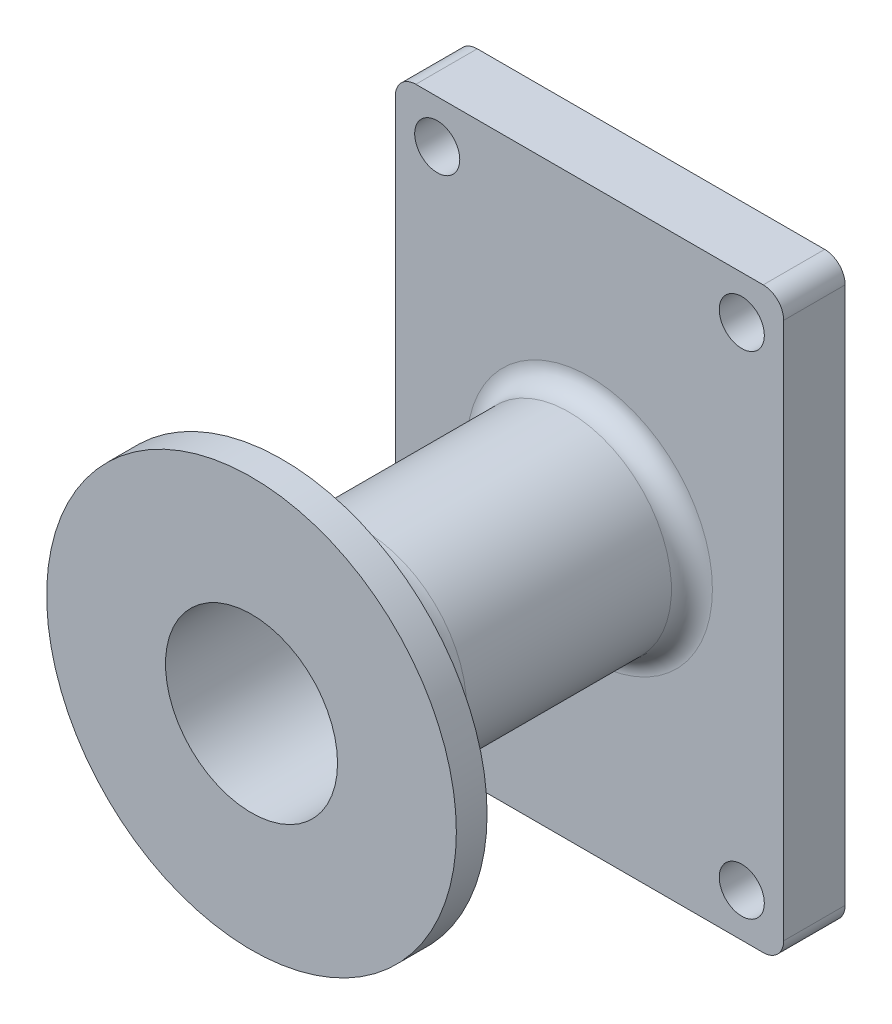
ISO-10303-21;
HEADER;
FILE_DESCRIPTION(('STEP AP214'),'2;1');
FILE_NAME('part.step','',(''),(''),'','','');
FILE_SCHEMA(('AUTOMOTIVE_DESIGN { 1 0 10303 214 1 1 1 1 }'));
ENDSEC;
DATA;
#1=APPLICATION_CONTEXT('core data for automotive mechanical design processes');
#2=APPLICATION_PROTOCOL_DEFINITION('international standard','automotive_design',2000,#1);
#3=PRODUCT_CONTEXT('',#1,'mechanical');
#4=PRODUCT('Part','Part','',(#3));
#5=PRODUCT_RELATED_PRODUCT_CATEGORY('part','',(#4));
#6=PRODUCT_DEFINITION_FORMATION('','',#4);
#7=PRODUCT_DEFINITION_CONTEXT('part definition',#1,'design');
#8=PRODUCT_DEFINITION('design','',#6,#7);
#9=PRODUCT_DEFINITION_SHAPE('','',#8);
#10=(LENGTH_UNIT() NAMED_UNIT(*) SI_UNIT(.MILLI.,.METRE.));
#11=(NAMED_UNIT(*) PLANE_ANGLE_UNIT() SI_UNIT($,.RADIAN.));
#12=(NAMED_UNIT(*) SI_UNIT($,.STERADIAN.) SOLID_ANGLE_UNIT());
#13=UNCERTAINTY_MEASURE_WITH_UNIT(LENGTH_MEASURE(1.E-05),#10,'distance_accuracy_value','');
#14=(GEOMETRIC_REPRESENTATION_CONTEXT(3) GLOBAL_UNCERTAINTY_ASSIGNED_CONTEXT((#13)) GLOBAL_UNIT_ASSIGNED_CONTEXT((#10,
#11,#12)) REPRESENTATION_CONTEXT('',''));
#15=CARTESIAN_POINT('',(0.,0.,0.));
#16=DIRECTION('',(0.,0.,1.));
#17=DIRECTION('',(1.,0.,0.));
#18=AXIS2_PLACEMENT_3D('',#15,#16,#17);
#19=CARTESIAN_POINT('',(-218.862203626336,-296.144190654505,3.));
#20=DIRECTION('',(0.,0.,-1.));
#21=DIRECTION('',(-1.,0.,0.));
#22=AXIS2_PLACEMENT_3D('',#19,#20,#21);
#23=PLANE('',#22);
#24=CARTESIAN_POINT('',(-227.342156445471,-283.028662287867,3.));
#25=DIRECTION('',(0.,0.,-1.));
#26=DIRECTION('',(-1.,0.,0.));
#27=AXIS2_PLACEMENT_3D('',#24,#25,#26);
#28=CIRCLE('',#27,5.99999999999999);
#29=CARTESIAN_POINT('',(-233.342156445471,-283.028662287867,3.));
#30=VERTEX_POINT('',#29);
#31=EDGE_CURVE('E11',#30,#30,#28,.T.);
#32=ORIENTED_EDGE('',*,*,#31,.T.);
#33=EDGE_LOOP('',(#32));
#34=FACE_BOUND('',#33,.T.);
#35=CARTESIAN_POINT('',(-234.775876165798,-295.028662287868,3.));
#36=DIRECTION('',(0.,0.,1.));
#37=DIRECTION('',(1.,0.,0.));
#38=AXIS2_PLACEMENT_3D('',#35,#36,#37);
#39=CIRCLE('',#38,1.09999999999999);
#40=CARTESIAN_POINT('',(-233.675876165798,-295.028662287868,3.));
#41=VERTEX_POINT('',#40);
#42=EDGE_CURVE('E248',#41,#41,#39,.T.);
#43=ORIENTED_EDGE('',*,*,#42,.F.);
#44=EDGE_LOOP('',(#43));
#45=FACE_BOUND('',#44,.T.);
#46=CARTESIAN_POINT('',(-219.908436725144,-271.028662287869,3.));
#47=DIRECTION('',(0.,0.,1.));
#48=DIRECTION('',(1.,0.,0.));
#49=AXIS2_PLACEMENT_3D('',#46,#47,#48);
#50=CIRCLE('',#49,1.09999999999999);
#51=CARTESIAN_POINT('',(-218.808436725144,-271.028662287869,3.));
#52=VERTEX_POINT('',#51);
#53=EDGE_CURVE('E135',#52,#52,#50,.T.);
#54=ORIENTED_EDGE('',*,*,#53,.F.);
#55=EDGE_LOOP('',(#54));
#56=FACE_BOUND('',#55,.T.);
#57=CARTESIAN_POINT('',(-218.862203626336,-296.144190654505,3.));
#58=DIRECTION('',(0.,0.,1.));
#59=DIRECTION('',(-1.,0.,0.));
#60=AXIS2_PLACEMENT_3D('',#57,#58,#59);
#61=CIRCLE('',#60,1.);
#62=CARTESIAN_POINT('',(-218.862203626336,-297.144190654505,3.));
#63=VERTEX_POINT('',#62);
#64=CARTESIAN_POINT('',(-217.862203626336,-296.144190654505,3.));
#65=VERTEX_POINT('',#64);
#66=EDGE_CURVE('E146',#63,#65,#61,.T.);
#67=ORIENTED_EDGE('',*,*,#66,.T.);
#68=DIRECTION('',(0.,1.,0.));
#69=VECTOR('',#68,1.);
#70=CARTESIAN_POINT('',(-217.862203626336,-296.144190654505,3.));
#71=LINE('',#70,#69);
#72=CARTESIAN_POINT('',(-217.862203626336,-269.91313392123,3.));
#73=VERTEX_POINT('',#72);
#74=EDGE_CURVE('E94',#65,#73,#71,.T.);
#75=ORIENTED_EDGE('',*,*,#74,.T.);
#76=CARTESIAN_POINT('',(-218.862203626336,-269.91313392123,3.));
#77=DIRECTION('',(0.,0.,1.));
#78=DIRECTION('',(1.,0.,0.));
#79=AXIS2_PLACEMENT_3D('',#76,#77,#78);
#80=CIRCLE('',#79,1.);
#81=CARTESIAN_POINT('',(-218.862203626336,-268.91313392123,3.));
#82=VERTEX_POINT('',#81);
#83=EDGE_CURVE('E231',#73,#82,#80,.T.);
#84=ORIENTED_EDGE('',*,*,#83,.T.);
#85=DIRECTION('',(-1.,0.,0.));
#86=VECTOR('',#85,1.);
#87=CARTESIAN_POINT('',(-235.822109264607,-268.91313392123,3.));
#88=LINE('',#87,#86);
#89=CARTESIAN_POINT('',(-235.822109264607,-268.91313392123,3.));
#90=VERTEX_POINT('',#89);
#91=EDGE_CURVE('E233',#82,#90,#88,.T.);
#92=ORIENTED_EDGE('',*,*,#91,.T.);
#93=CARTESIAN_POINT('',(-235.822109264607,-269.91313392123,3.));
#94=DIRECTION('',(0.,0.,1.));
#95=DIRECTION('',(-1.,0.,0.));
#96=AXIS2_PLACEMENT_3D('',#93,#94,#95);
#97=CIRCLE('',#96,1.);
#98=CARTESIAN_POINT('',(-236.822109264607,-269.91313392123,3.));
#99=VERTEX_POINT('',#98);
#100=EDGE_CURVE('E113',#90,#99,#97,.T.);
#101=ORIENTED_EDGE('',*,*,#100,.T.);
#102=DIRECTION('',(0.,-1.,0.));
#103=VECTOR('',#102,1.);
#104=CARTESIAN_POINT('',(-236.822109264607,-296.144190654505,3.));
#105=LINE('',#104,#103);
#106=CARTESIAN_POINT('',(-236.822109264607,-296.144190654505,3.));
#107=VERTEX_POINT('',#106);
#108=EDGE_CURVE('E107',#99,#107,#105,.T.);
#109=ORIENTED_EDGE('',*,*,#108,.T.);
#110=CARTESIAN_POINT('',(-235.822109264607,-296.144190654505,3.));
#111=DIRECTION('',(0.,0.,1.));
#112=DIRECTION('',(-1.,0.,0.));
#113=AXIS2_PLACEMENT_3D('',#110,#111,#112);
#114=CIRCLE('',#113,1.);
#115=CARTESIAN_POINT('',(-235.822109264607,-297.144190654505,3.));
#116=VERTEX_POINT('',#115);
#117=EDGE_CURVE('E111',#107,#116,#114,.T.);
#118=ORIENTED_EDGE('',*,*,#117,.T.);
#119=DIRECTION('',(1.,0.,0.));
#120=VECTOR('',#119,1.);
#121=CARTESIAN_POINT('',(-235.822109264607,-297.144190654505,3.));
#122=LINE('',#121,#120);
#123=EDGE_CURVE('E50',#116,#63,#122,.T.);
#124=ORIENTED_EDGE('',*,*,#123,.T.);
#125=EDGE_LOOP('',(#67,#75,#84,#92,#101,#109,#118,#124));
#126=FACE_BOUND('',#125,.T.);
#127=CARTESIAN_POINT('',(-219.908436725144,-295.028662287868,3.));
#128=DIRECTION('',(0.,0.,1.));
#129=DIRECTION('',(1.,0.,0.));
#130=AXIS2_PLACEMENT_3D('',#127,#128,#129);
#131=CIRCLE('',#130,1.09999999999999);
#132=CARTESIAN_POINT('',(-218.808436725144,-295.028662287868,3.));
#133=VERTEX_POINT('',#132);
#134=EDGE_CURVE('E242',#133,#133,#131,.T.);
#135=ORIENTED_EDGE('',*,*,#134,.F.);
#136=EDGE_LOOP('',(#135));
#137=FACE_BOUND('',#136,.T.);
#138=CARTESIAN_POINT('',(-234.775876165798,-271.028662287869,3.));
#139=DIRECTION('',(0.,0.,1.));
#140=DIRECTION('',(1.,0.,0.));
#141=AXIS2_PLACEMENT_3D('',#138,#139,#140);
#142=CIRCLE('',#141,1.09999999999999);
#143=CARTESIAN_POINT('',(-233.675876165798,-271.028662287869,3.));
#144=VERTEX_POINT('',#143);
#145=EDGE_CURVE('E254',#144,#144,#142,.T.);
#146=ORIENTED_EDGE('',*,*,#145,.F.);
#147=EDGE_LOOP('',(#146));
#148=FACE_BOUND('',#147,.T.);
#149=ADVANCED_FACE('F33',(#34,#45,#56,#126,#137,#148),#23,.F.);
#150=CARTESIAN_POINT('',(-218.862203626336,-296.144190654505,0.));
#151=DIRECTION('',(0.,0.,-1.));
#152=DIRECTION('',(-1.,0.,0.));
#153=AXIS2_PLACEMENT_3D('',#150,#151,#152);
#154=PLANE('',#153);
#155=CARTESIAN_POINT('',(-234.775876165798,-271.028662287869,0.));
#156=DIRECTION('',(0.,0.,1.));
#157=DIRECTION('',(1.,0.,0.));
#158=AXIS2_PLACEMENT_3D('',#155,#156,#157);
#159=CIRCLE('',#158,1.09999999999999);
#160=CARTESIAN_POINT('',(-233.675876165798,-271.028662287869,0.));
#161=VERTEX_POINT('',#160);
#162=EDGE_CURVE('E257',#161,#161,#159,.T.);
#163=ORIENTED_EDGE('',*,*,#162,.T.);
#164=EDGE_LOOP('',(#163));
#165=FACE_BOUND('',#164,.T.);
#166=CARTESIAN_POINT('',(-219.908436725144,-295.028662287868,0.));
#167=DIRECTION('',(0.,0.,1.));
#168=DIRECTION('',(1.,0.,0.));
#169=AXIS2_PLACEMENT_3D('',#166,#167,#168);
#170=CIRCLE('',#169,1.09999999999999);
#171=CARTESIAN_POINT('',(-218.808436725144,-295.028662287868,0.));
#172=VERTEX_POINT('',#171);
#173=EDGE_CURVE('E245',#172,#172,#170,.T.);
#174=ORIENTED_EDGE('',*,*,#173,.T.);
#175=EDGE_LOOP('',(#174));
#176=FACE_BOUND('',#175,.T.);
#177=CARTESIAN_POINT('',(-218.862203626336,-296.144190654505,0.));
#178=DIRECTION('',(0.,0.,1.));
#179=DIRECTION('',(-1.,0.,0.));
#180=AXIS2_PLACEMENT_3D('',#177,#178,#179);
#181=CIRCLE('',#180,1.);
#182=CARTESIAN_POINT('',(-218.862203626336,-297.144190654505,0.));
#183=VERTEX_POINT('',#182);
#184=CARTESIAN_POINT('',(-217.862203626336,-296.144190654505,0.));
#185=VERTEX_POINT('',#184);
#186=EDGE_CURVE('E131',#183,#185,#181,.T.);
#187=ORIENTED_EDGE('',*,*,#186,.F.);
#188=DIRECTION('',(1.,0.,0.));
#189=VECTOR('',#188,1.);
#190=CARTESIAN_POINT('',(-235.822109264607,-297.144190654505,0.));
#191=LINE('',#190,#189);
#192=CARTESIAN_POINT('',(-235.822109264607,-297.144190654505,0.));
#193=VERTEX_POINT('',#192);
#194=EDGE_CURVE('E85',#193,#183,#191,.T.);
#195=ORIENTED_EDGE('',*,*,#194,.F.);
#196=CARTESIAN_POINT('',(-235.822109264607,-296.144190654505,0.));
#197=DIRECTION('',(0.,0.,1.));
#198=DIRECTION('',(-1.,0.,0.));
#199=AXIS2_PLACEMENT_3D('',#196,#197,#198);
#200=CIRCLE('',#199,1.);
#201=CARTESIAN_POINT('',(-236.822109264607,-296.144190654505,0.));
#202=VERTEX_POINT('',#201);
#203=EDGE_CURVE('E79',#202,#193,#200,.T.);
#204=ORIENTED_EDGE('',*,*,#203,.F.);
#205=DIRECTION('',(0.,-1.,0.));
#206=VECTOR('',#205,1.);
#207=CARTESIAN_POINT('',(-236.822109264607,-296.144190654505,0.));
#208=LINE('',#207,#206);
#209=CARTESIAN_POINT('',(-236.822109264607,-269.91313392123,0.));
#210=VERTEX_POINT('',#209);
#211=EDGE_CURVE('E121',#210,#202,#208,.T.);
#212=ORIENTED_EDGE('',*,*,#211,.F.);
#213=CARTESIAN_POINT('',(-235.822109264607,-269.91313392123,0.));
#214=DIRECTION('',(0.,0.,1.));
#215=DIRECTION('',(-1.,0.,0.));
#216=AXIS2_PLACEMENT_3D('',#213,#214,#215);
#217=CIRCLE('',#216,1.);
#218=CARTESIAN_POINT('',(-235.822109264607,-268.91313392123,0.));
#219=VERTEX_POINT('',#218);
#220=EDGE_CURVE('E141',#219,#210,#217,.T.);
#221=ORIENTED_EDGE('',*,*,#220,.F.);
#222=DIRECTION('',(-1.,0.,0.));
#223=VECTOR('',#222,1.);
#224=CARTESIAN_POINT('',(-235.822109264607,-268.91313392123,0.));
#225=LINE('',#224,#223);
#226=CARTESIAN_POINT('',(-218.862203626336,-268.91313392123,0.));
#227=VERTEX_POINT('',#226);
#228=EDGE_CURVE('E139',#227,#219,#225,.T.);
#229=ORIENTED_EDGE('',*,*,#228,.F.);
#230=CARTESIAN_POINT('',(-218.862203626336,-269.91313392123,0.));
#231=DIRECTION('',(0.,0.,1.));
#232=DIRECTION('',(1.,0.,0.));
#233=AXIS2_PLACEMENT_3D('',#230,#231,#232);
#234=CIRCLE('',#233,1.);
#235=CARTESIAN_POINT('',(-217.862203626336,-269.91313392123,0.));
#236=VERTEX_POINT('',#235);
#237=EDGE_CURVE('E137',#236,#227,#234,.T.);
#238=ORIENTED_EDGE('',*,*,#237,.F.);
#239=DIRECTION('',(0.,1.,0.));
#240=VECTOR('',#239,1.);
#241=CARTESIAN_POINT('',(-217.862203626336,-296.144190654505,0.));
#242=LINE('',#241,#240);
#243=EDGE_CURVE('E134',#185,#236,#242,.T.);
#244=ORIENTED_EDGE('',*,*,#243,.F.);
#245=EDGE_LOOP('',(#187,#195,#204,#212,#221,#229,#238,#244));
#246=FACE_BOUND('',#245,.T.);
#247=CARTESIAN_POINT('',(-219.908436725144,-271.028662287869,0.));
#248=DIRECTION('',(0.,0.,1.));
#249=DIRECTION('',(1.,0.,0.));
#250=AXIS2_PLACEMENT_3D('',#247,#248,#249);
#251=CIRCLE('',#250,1.09999999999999);
#252=CARTESIAN_POINT('',(-218.808436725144,-271.028662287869,0.));
#253=VERTEX_POINT('',#252);
#254=EDGE_CURVE('E239',#253,#253,#251,.T.);
#255=ORIENTED_EDGE('',*,*,#254,.T.);
#256=EDGE_LOOP('',(#255));
#257=FACE_BOUND('',#256,.T.);
#258=CARTESIAN_POINT('',(-234.775876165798,-295.028662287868,0.));
#259=DIRECTION('',(0.,0.,1.));
#260=DIRECTION('',(1.,0.,0.));
#261=AXIS2_PLACEMENT_3D('',#258,#259,#260);
#262=CIRCLE('',#261,1.09999999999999);
#263=CARTESIAN_POINT('',(-233.675876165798,-295.028662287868,0.));
#264=VERTEX_POINT('',#263);
#265=EDGE_CURVE('E251',#264,#264,#262,.T.);
#266=ORIENTED_EDGE('',*,*,#265,.T.);
#267=EDGE_LOOP('',(#266));
#268=FACE_BOUND('',#267,.T.);
#269=CARTESIAN_POINT('',(-227.342156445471,-283.028662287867,0.));
#270=DIRECTION('',(0.,0.,1.));
#271=DIRECTION('',(1.,0.,0.));
#272=AXIS2_PLACEMENT_3D('',#269,#270,#271);
#273=CIRCLE('',#272,4.2);
#274=CARTESIAN_POINT('',(-223.142156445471,-283.028662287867,0.));
#275=VERTEX_POINT('',#274);
#276=EDGE_CURVE('E260',#275,#275,#273,.T.);
#277=ORIENTED_EDGE('',*,*,#276,.T.);
#278=EDGE_LOOP('',(#277));
#279=FACE_BOUND('',#278,.T.);
#280=ADVANCED_FACE('F182',(#165,#176,#246,#257,#268,#279),#154,.T.);
#281=CARTESIAN_POINT('',(-218.862203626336,-296.144190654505,3.));
#282=DIRECTION('',(0.,0.,-1.));
#283=DIRECTION('',(-1.,0.,0.));
#284=AXIS2_PLACEMENT_3D('',#281,#282,#283);
#285=CYLINDRICAL_SURFACE('',#284,1.);
#286=ORIENTED_EDGE('',*,*,#186,.T.);
#287=DIRECTION('',(0.,0.,-1.));
#288=VECTOR('',#287,1.);
#289=CARTESIAN_POINT('',(-217.862203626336,-296.144190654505,3.));
#290=LINE('',#289,#288);
#291=EDGE_CURVE('E159',#65,#185,#290,.T.);
#292=ORIENTED_EDGE('',*,*,#291,.F.);
#293=ORIENTED_EDGE('',*,*,#66,.F.);
#294=DIRECTION('',(0.,0.,-1.));
#295=VECTOR('',#294,1.);
#296=CARTESIAN_POINT('',(-218.862203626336,-297.144190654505,3.));
#297=LINE('',#296,#295);
#298=EDGE_CURVE('E127',#63,#183,#297,.T.);
#299=ORIENTED_EDGE('',*,*,#298,.T.);
#300=EDGE_LOOP('',(#286,#292,#293,#299));
#301=FACE_BOUND('',#300,.T.);
#302=ADVANCED_FACE('F188',(#301),#285,.T.);
#303=CARTESIAN_POINT('',(-217.862203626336,-296.144190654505,3.));
#304=DIRECTION('',(-1.,0.,0.));
#305=DIRECTION('',(0.,0.,1.));
#306=AXIS2_PLACEMENT_3D('',#303,#304,#305);
#307=PLANE('',#306);
#308=ORIENTED_EDGE('',*,*,#243,.T.);
#309=DIRECTION('',(0.,0.,-1.));
#310=VECTOR('',#309,1.);
#311=CARTESIAN_POINT('',(-217.862203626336,-269.91313392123,3.));
#312=LINE('',#311,#310);
#313=EDGE_CURVE('E156',#73,#236,#312,.T.);
#314=ORIENTED_EDGE('',*,*,#313,.F.);
#315=ORIENTED_EDGE('',*,*,#74,.F.);
#316=ORIENTED_EDGE('',*,*,#291,.T.);
#317=EDGE_LOOP('',(#308,#314,#315,#316));
#318=FACE_BOUND('',#317,.T.);
#319=ADVANCED_FACE('F214',(#318),#307,.F.);
#320=CARTESIAN_POINT('',(-218.862203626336,-269.91313392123,3.));
#321=DIRECTION('',(0.,0.,-1.));
#322=DIRECTION('',(-1.,0.,0.));
#323=AXIS2_PLACEMENT_3D('',#320,#321,#322);
#324=CYLINDRICAL_SURFACE('',#323,1.);
#325=ORIENTED_EDGE('',*,*,#237,.T.);
#326=DIRECTION('',(0.,0.,-1.));
#327=VECTOR('',#326,1.);
#328=CARTESIAN_POINT('',(-218.862203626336,-268.91313392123,3.));
#329=LINE('',#328,#327);
#330=EDGE_CURVE('E153',#82,#227,#329,.T.);
#331=ORIENTED_EDGE('',*,*,#330,.F.);
#332=ORIENTED_EDGE('',*,*,#83,.F.);
#333=ORIENTED_EDGE('',*,*,#313,.T.);
#334=EDGE_LOOP('',(#325,#331,#332,#333));
#335=FACE_BOUND('',#334,.T.);
#336=ADVANCED_FACE('F210',(#335),#324,.T.);
#337=CARTESIAN_POINT('',(-235.822109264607,-268.91313392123,3.));
#338=DIRECTION('',(0.,-1.,0.));
#339=DIRECTION('',(0.,0.,-1.));
#340=AXIS2_PLACEMENT_3D('',#337,#338,#339);
#341=PLANE('',#340);
#342=ORIENTED_EDGE('',*,*,#228,.T.);
#343=DIRECTION('',(0.,0.,-1.));
#344=VECTOR('',#343,1.);
#345=CARTESIAN_POINT('',(-235.822109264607,-268.91313392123,3.));
#346=LINE('',#345,#344);
#347=EDGE_CURVE('E150',#90,#219,#346,.T.);
#348=ORIENTED_EDGE('',*,*,#347,.F.);
#349=ORIENTED_EDGE('',*,*,#91,.F.);
#350=ORIENTED_EDGE('',*,*,#330,.T.);
#351=EDGE_LOOP('',(#342,#348,#349,#350));
#352=FACE_BOUND('',#351,.T.);
#353=ADVANCED_FACE('F206',(#352),#341,.F.);
#354=CARTESIAN_POINT('',(-235.822109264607,-269.91313392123,3.));
#355=DIRECTION('',(0.,0.,-1.));
#356=DIRECTION('',(-1.,0.,0.));
#357=AXIS2_PLACEMENT_3D('',#354,#355,#356);
#358=CYLINDRICAL_SURFACE('',#357,1.);
#359=ORIENTED_EDGE('',*,*,#220,.T.);
#360=DIRECTION('',(0.,0.,-1.));
#361=VECTOR('',#360,1.);
#362=CARTESIAN_POINT('',(-236.822109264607,-269.91313392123,3.));
#363=LINE('',#362,#361);
#364=EDGE_CURVE('E122',#99,#210,#363,.T.);
#365=ORIENTED_EDGE('',*,*,#364,.F.);
#366=ORIENTED_EDGE('',*,*,#100,.F.);
#367=ORIENTED_EDGE('',*,*,#347,.T.);
#368=EDGE_LOOP('',(#359,#365,#366,#367));
#369=FACE_BOUND('',#368,.T.);
#370=ADVANCED_FACE('F203',(#369),#358,.T.);
#371=CARTESIAN_POINT('',(-236.822109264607,-296.144190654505,3.));
#372=DIRECTION('',(1.,0.,0.));
#373=DIRECTION('',(0.,0.,-1.));
#374=AXIS2_PLACEMENT_3D('',#371,#372,#373);
#375=PLANE('',#374);
#376=ORIENTED_EDGE('',*,*,#211,.T.);
#377=DIRECTION('',(0.,0.,-1.));
#378=VECTOR('',#377,1.);
#379=CARTESIAN_POINT('',(-236.822109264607,-296.144190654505,3.));
#380=LINE('',#379,#378);
#381=EDGE_CURVE('E118',#107,#202,#380,.T.);
#382=ORIENTED_EDGE('',*,*,#381,.F.);
#383=ORIENTED_EDGE('',*,*,#108,.F.);
#384=ORIENTED_EDGE('',*,*,#364,.T.);
#385=EDGE_LOOP('',(#376,#382,#383,#384));
#386=FACE_BOUND('',#385,.T.);
#387=ADVANCED_FACE('F119',(#386),#375,.F.);
#388=CARTESIAN_POINT('',(-235.822109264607,-296.144190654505,3.));
#389=DIRECTION('',(0.,0.,-1.));
#390=DIRECTION('',(-1.,0.,0.));
#391=AXIS2_PLACEMENT_3D('',#388,#389,#390);
#392=CYLINDRICAL_SURFACE('',#391,1.);
#393=ORIENTED_EDGE('',*,*,#203,.T.);
#394=DIRECTION('',(0.,0.,-1.));
#395=VECTOR('',#394,1.);
#396=CARTESIAN_POINT('',(-235.822109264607,-297.144190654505,3.));
#397=LINE('',#396,#395);
#398=EDGE_CURVE('E123',#116,#193,#397,.T.);
#399=ORIENTED_EDGE('',*,*,#398,.F.);
#400=ORIENTED_EDGE('',*,*,#117,.F.);
#401=ORIENTED_EDGE('',*,*,#381,.T.);
#402=EDGE_LOOP('',(#393,#399,#400,#401));
#403=FACE_BOUND('',#402,.T.);
#404=ADVANCED_FACE('F125',(#403),#392,.T.);
#405=CARTESIAN_POINT('',(-235.822109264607,-297.144190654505,3.));
#406=DIRECTION('',(0.,1.,0.));
#407=DIRECTION('',(0.,0.,1.));
#408=AXIS2_PLACEMENT_3D('',#405,#406,#407);
#409=PLANE('',#408);
#410=ORIENTED_EDGE('',*,*,#194,.T.);
#411=ORIENTED_EDGE('',*,*,#298,.F.);
#412=ORIENTED_EDGE('',*,*,#123,.F.);
#413=ORIENTED_EDGE('',*,*,#398,.T.);
#414=EDGE_LOOP('',(#410,#411,#412,#413));
#415=FACE_BOUND('',#414,.T.);
#416=ADVANCED_FACE('F196',(#415),#409,.F.);
#417=CARTESIAN_POINT('',(-219.908436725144,-271.028662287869,3.));
#418=DIRECTION('',(0.,0.,-1.));
#419=DIRECTION('',(-1.,0.,0.));
#420=AXIS2_PLACEMENT_3D('',#417,#418,#419);
#421=CYLINDRICAL_SURFACE('',#420,1.09999999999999);
#422=ORIENTED_EDGE('',*,*,#53,.T.);
#423=EDGE_LOOP('',(#422));
#424=FACE_BOUND('',#423,.T.);
#425=ORIENTED_EDGE('',*,*,#254,.F.);
#426=EDGE_LOOP('',(#425));
#427=FACE_BOUND('',#426,.T.);
#428=ADVANCED_FACE('F193',(#424,#427),#421,.F.);
#429=CARTESIAN_POINT('',(-219.908436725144,-295.028662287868,3.));
#430=DIRECTION('',(0.,0.,-1.));
#431=DIRECTION('',(-1.,0.,0.));
#432=AXIS2_PLACEMENT_3D('',#429,#430,#431);
#433=CYLINDRICAL_SURFACE('',#432,1.09999999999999);
#434=ORIENTED_EDGE('',*,*,#134,.T.);
#435=EDGE_LOOP('',(#434));
#436=FACE_BOUND('',#435,.T.);
#437=ORIENTED_EDGE('',*,*,#173,.F.);
#438=EDGE_LOOP('',(#437));
#439=FACE_BOUND('',#438,.T.);
#440=ADVANCED_FACE('F301',(#436,#439),#433,.F.);
#441=CARTESIAN_POINT('',(-234.775876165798,-295.028662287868,3.));
#442=DIRECTION('',(0.,0.,-1.));
#443=DIRECTION('',(-1.,0.,0.));
#444=AXIS2_PLACEMENT_3D('',#441,#442,#443);
#445=CYLINDRICAL_SURFACE('',#444,1.09999999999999);
#446=ORIENTED_EDGE('',*,*,#42,.T.);
#447=EDGE_LOOP('',(#446));
#448=FACE_BOUND('',#447,.T.);
#449=ORIENTED_EDGE('',*,*,#265,.F.);
#450=EDGE_LOOP('',(#449));
#451=FACE_BOUND('',#450,.T.);
#452=ADVANCED_FACE('F298',(#448,#451),#445,.F.);
#453=CARTESIAN_POINT('',(-234.775876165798,-271.028662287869,3.));
#454=DIRECTION('',(0.,0.,-1.));
#455=DIRECTION('',(-1.,0.,0.));
#456=AXIS2_PLACEMENT_3D('',#453,#454,#455);
#457=CYLINDRICAL_SURFACE('',#456,1.09999999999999);
#458=ORIENTED_EDGE('',*,*,#145,.T.);
#459=EDGE_LOOP('',(#458));
#460=FACE_BOUND('',#459,.T.);
#461=ORIENTED_EDGE('',*,*,#162,.F.);
#462=EDGE_LOOP('',(#461));
#463=FACE_BOUND('',#462,.T.);
#464=ADVANCED_FACE('F294',(#460,#463),#457,.F.);
#465=CARTESIAN_POINT('',(-227.342156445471,-283.028662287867,3.));
#466=DIRECTION('',(0.,0.,-1.));
#467=DIRECTION('',(-1.,0.,0.));
#468=AXIS2_PLACEMENT_3D('',#465,#466,#467);
#469=CYLINDRICAL_SURFACE('',#468,4.2);
#470=CARTESIAN_POINT('',(-227.342156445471,-283.028662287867,19.5));
#471=DIRECTION('',(0.,0.,1.));
#472=DIRECTION('',(1.,0.,0.));
#473=AXIS2_PLACEMENT_3D('',#470,#471,#472);
#474=CIRCLE('',#473,4.2);
#475=CARTESIAN_POINT('',(-223.142156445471,-283.028662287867,19.5));
#476=VERTEX_POINT('',#475);
#477=EDGE_CURVE('E265',#476,#476,#474,.T.);
#478=ORIENTED_EDGE('',*,*,#477,.T.);
#479=EDGE_LOOP('',(#478));
#480=FACE_BOUND('',#479,.T.);
#481=ORIENTED_EDGE('',*,*,#276,.F.);
#482=EDGE_LOOP('',(#481));
#483=FACE_BOUND('',#482,.T.);
#484=ADVANCED_FACE('F288',(#480,#483),#469,.F.);
#485=CARTESIAN_POINT('',(-227.342156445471,-283.028662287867,18.));
#486=DIRECTION('',(0.,0.,-1.));
#487=DIRECTION('',(-1.,0.,0.));
#488=AXIS2_PLACEMENT_3D('',#485,#486,#487);
#489=CYLINDRICAL_SURFACE('',#488,4.99999999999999);
#490=CARTESIAN_POINT('',(-227.342156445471,-283.028662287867,4.));
#491=DIRECTION('',(0.,0.,-1.));
#492=DIRECTION('',(-1.,0.,0.));
#493=AXIS2_PLACEMENT_3D('',#490,#491,#492);
#494=CIRCLE('',#493,4.99999999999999);
#495=CARTESIAN_POINT('',(-232.342156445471,-283.028662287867,4.));
#496=VERTEX_POINT('',#495);
#497=EDGE_CURVE('E42',#496,#496,#494,.F.);
#498=ORIENTED_EDGE('',*,*,#497,.T.);
#499=EDGE_LOOP('',(#498));
#500=FACE_BOUND('',#499,.T.);
#501=CARTESIAN_POINT('',(-227.342156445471,-283.028662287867,14.));
#502=DIRECTION('',(0.,0.,1.));
#503=DIRECTION('',(1.,0.,0.));
#504=AXIS2_PLACEMENT_3D('',#501,#502,#503);
#505=CIRCLE('',#504,4.99999999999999);
#506=CARTESIAN_POINT('',(-222.342156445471,-283.028662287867,14.));
#507=VERTEX_POINT('',#506);
#508=EDGE_CURVE('E164',#507,#507,#505,.F.);
#509=ORIENTED_EDGE('',*,*,#508,.T.);
#510=EDGE_LOOP('',(#509));
#511=FACE_BOUND('',#510,.T.);
#512=ADVANCED_FACE('F169',(#500,#511),#489,.T.);
#513=CARTESIAN_POINT('',(-227.342156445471,-283.028662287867,18.));
#514=DIRECTION('',(0.,0.,1.));
#515=DIRECTION('',(1.,0.,0.));
#516=AXIS2_PLACEMENT_3D('',#513,#514,#515);
#517=PLANE('',#516);
#518=CARTESIAN_POINT('',(-227.342156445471,-283.028662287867,18.));
#519=DIRECTION('',(0.,0.,1.));
#520=DIRECTION('',(1.,0.,0.));
#521=AXIS2_PLACEMENT_3D('',#518,#519,#520);
#522=CIRCLE('',#521,8.99999999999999);
#523=CARTESIAN_POINT('',(-218.342156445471,-283.028662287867,18.));
#524=VERTEX_POINT('',#523);
#525=EDGE_CURVE('E161',#524,#524,#522,.T.);
#526=ORIENTED_EDGE('',*,*,#525,.T.);
#527=EDGE_LOOP('',(#526));
#528=FACE_BOUND('',#527,.T.);
#529=CARTESIAN_POINT('',(-227.342156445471,-283.028662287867,18.));
#530=DIRECTION('',(0.,0.,1.));
#531=DIRECTION('',(1.,0.,0.));
#532=AXIS2_PLACEMENT_3D('',#529,#530,#531);
#533=CIRCLE('',#532,10.);
#534=CARTESIAN_POINT('',(-217.342156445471,-283.028662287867,18.));
#535=VERTEX_POINT('',#534);
#536=EDGE_CURVE('E268',#535,#535,#533,.T.);
#537=ORIENTED_EDGE('',*,*,#536,.F.);
#538=EDGE_LOOP('',(#537));
#539=FACE_BOUND('',#538,.T.);
#540=ADVANCED_FACE('F277',(#528,#539),#517,.F.);
#541=CARTESIAN_POINT('',(-227.342156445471,-283.028662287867,19.5));
#542=DIRECTION('',(0.,0.,1.));
#543=DIRECTION('',(1.,0.,0.));
#544=AXIS2_PLACEMENT_3D('',#541,#542,#543);
#545=PLANE('',#544);
#546=ORIENTED_EDGE('',*,*,#477,.F.);
#547=EDGE_LOOP('',(#546));
#548=FACE_BOUND('',#547,.T.);
#549=CARTESIAN_POINT('',(-227.342156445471,-283.028662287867,19.5));
#550=DIRECTION('',(0.,0.,1.));
#551=DIRECTION('',(1.,0.,0.));
#552=AXIS2_PLACEMENT_3D('',#549,#550,#551);
#553=CIRCLE('',#552,10.);
#554=CARTESIAN_POINT('',(-217.342156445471,-283.028662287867,19.5));
#555=VERTEX_POINT('',#554);
#556=EDGE_CURVE('E269',#555,#555,#553,.T.);
#557=ORIENTED_EDGE('',*,*,#556,.T.);
#558=EDGE_LOOP('',(#557));
#559=FACE_BOUND('',#558,.T.);
#560=ADVANCED_FACE('F279',(#548,#559),#545,.T.);
#561=CARTESIAN_POINT('',(-227.342156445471,-283.028662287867,18.));
#562=DIRECTION('',(0.,0.,1.));
#563=DIRECTION('',(1.,0.,0.));
#564=AXIS2_PLACEMENT_3D('',#561,#562,#563);
#565=CYLINDRICAL_SURFACE('',#564,10.);
#566=ORIENTED_EDGE('',*,*,#536,.T.);
#567=EDGE_LOOP('',(#566));
#568=FACE_BOUND('',#567,.T.);
#569=ORIENTED_EDGE('',*,*,#556,.F.);
#570=EDGE_LOOP('',(#569));
#571=FACE_BOUND('',#570,.T.);
#572=ADVANCED_FACE('F178',(#568,#571),#565,.T.);
#573=CARTESIAN_POINT('',(-227.342156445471,-283.028662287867,14.));
#574=DIRECTION('',(0.,0.,1.));
#575=DIRECTION('',(1.,0.,0.));
#576=AXIS2_PLACEMENT_3D('',#573,#574,#575);
#577=TOROIDAL_SURFACE('',#576,8.99999999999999,4.);
#578=ORIENTED_EDGE('',*,*,#508,.F.);
#579=EDGE_LOOP('',(#578));
#580=FACE_BOUND('',#579,.T.);
#581=ORIENTED_EDGE('',*,*,#525,.F.);
#582=EDGE_LOOP('',(#581));
#583=FACE_BOUND('',#582,.T.);
#584=ADVANCED_FACE('F173',(#580,#583),#577,.F.);
#585=CARTESIAN_POINT('',(-227.342156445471,-283.028662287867,4.));
#586=DIRECTION('',(0.,0.,-1.));
#587=DIRECTION('',(-1.,0.,0.));
#588=AXIS2_PLACEMENT_3D('',#585,#586,#587);
#589=TOROIDAL_SURFACE('',#588,5.99999999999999,1.);
#590=ORIENTED_EDGE('',*,*,#31,.F.);
#591=EDGE_LOOP('',(#590));
#592=FACE_BOUND('',#591,.T.);
#593=ORIENTED_EDGE('',*,*,#497,.F.);
#594=EDGE_LOOP('',(#593));
#595=FACE_BOUND('',#594,.T.);
#596=ADVANCED_FACE('F35',(#592,#595),#589,.F.);
#597=CLOSED_SHELL('',(#149,#280,#302,#319,#336,#353,#370,#387,#404,#416,#428,#440,#452,#464,
#484,#512,#540,#560,#572,#584,#596));
#598=MANIFOLD_SOLID_BREP('B2',#597);
#599=ADVANCED_BREP_SHAPE_REPRESENTATION('',(#18,#598),#14);
#600=SHAPE_DEFINITION_REPRESENTATION(#9,#599);
ENDSEC;
END-ISO-10303-21;
